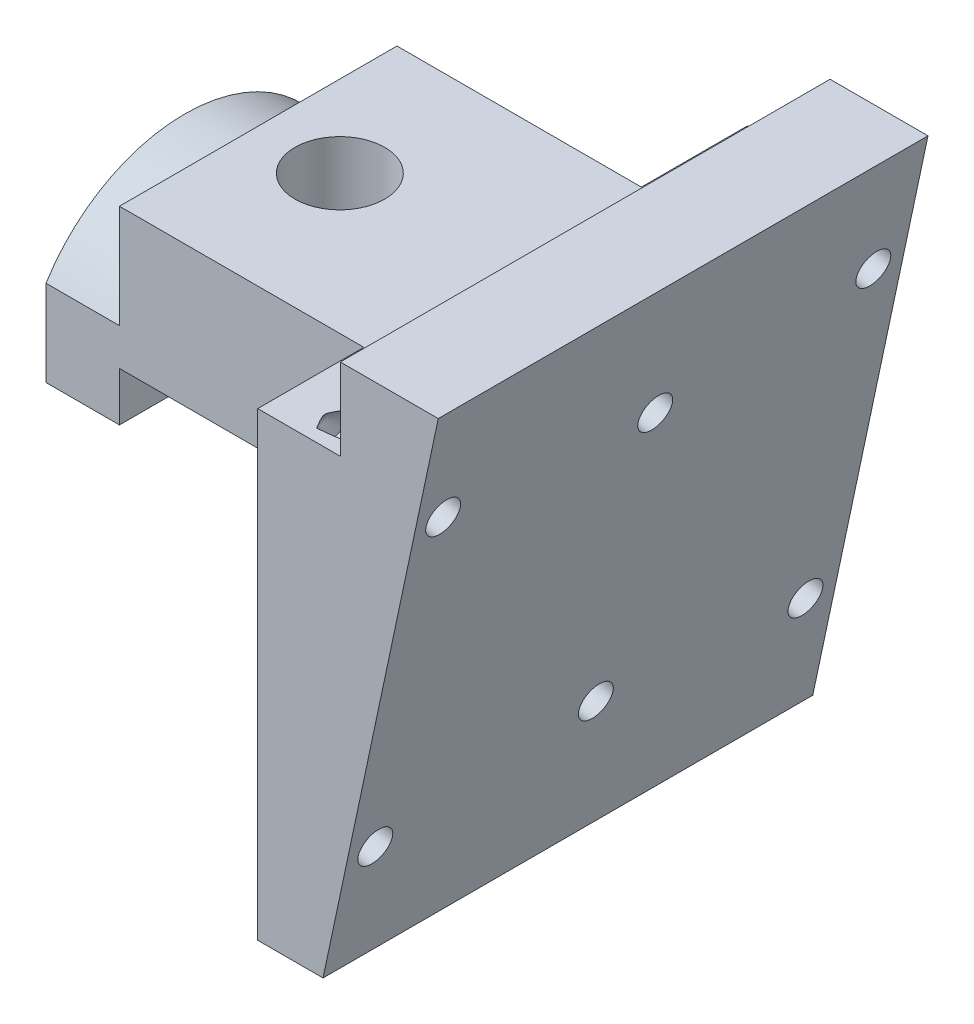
from build123d import *

# Parameters (mm, degrees)
EXTRUSION1_DEPTH          = 30
EXTRUSION2_DEPTH          = 17
ESQUISSE3_OUTSIDE_W       = 83.67
ESQUISSE3_OUTSIDE_H       = 90.086
ESQUISSE3_OUTSIDE_R       = 20
ENL_V_MAT_EXTRU_1_DEPTH   = 9
TROU_TARAUD_M5X0_81_D     = 4.2
TROU_TARAUD_M5X0_81_DEPTH = 14
TROU_TARAUD_M5X0_81_TIP   = 1.2618073
D_GAGEMENT_M101_D         = 11


with BuildPart() as part:
    # Esquisse1 → Extrusion1 (new, symmetric)
    with BuildSketch(Plane.XY):
        Polygon((103.941398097, -33.208111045), (118.058601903, 33.208111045), (106.058601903, 33.208111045), (106.058601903, 23.208111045), (95.941398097, 23.208111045), (95.941398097, -33.208111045), align=None)
    extrude(amount=EXTRUSION1_DEPTH, both=True)

    # Esquisse2 → Extrusion2 (add, symmetric)
    with BuildSketch(Plane.XY):
        Polygon((95.941398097, 23.208111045), (57, 23.208111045), (57, 0), (66, 0), (66, 6), (95.941398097, 6), align=None)
    extrude(amount=EXTRUSION2_DEPTH, both=True)

    # Esquisse3 outside → Enl_v. mat.-Extru.1 (cut)
    with BuildSketch(Plane.ZY.offset(-57)):
        Rectangle(ESQUISSE3_OUTSIDE_W, ESQUISSE3_OUTSIDE_H)
        Circle(ESQUISSE3_OUTSIDE_R, mode=Mode.SUBTRACT)
    extrude(amount=-ENL_V_MAT_EXTRU_1_DEPTH, mode=Mode.SUBTRACT)

    # Trou taraud_ M5x0.81
    with Locations(Plane(origin=(106.201772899, -22.573883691, 0), x_dir=(0, 0, -1), z_dir=(0.978147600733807, -0.207911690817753, 0))):
        with Locations((26.2, 3.078197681), (-26.5, 3.078197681), (-26.5, 43.078197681), (0, 40.578197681), (0, 5.578197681), (26.2, 43.078197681)):
            Hole(TROU_TARAUD_M5X0_81_D / 2, depth=TROU_TARAUD_M5X0_81_DEPTH)
            with Locations((0, 0, -(TROU_TARAUD_M5X0_81_DEPTH + TROU_TARAUD_M5X0_81_TIP / 2))):  # 118° drill point
                Cone(0, TROU_TARAUD_M5X0_81_D / 2, TROU_TARAUD_M5X0_81_TIP, mode=Mode.SUBTRACT)

    # D_gagement M101 (through all)
    with Locations(Plane(origin=(0, 23.208111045, 0), x_dir=(-1, 0, 0), z_dir=(0, 1, 0))):
        with Locations((-76, 0)):
            Hole(D_GAGEMENT_M101_D / 2)


solid = part.part
